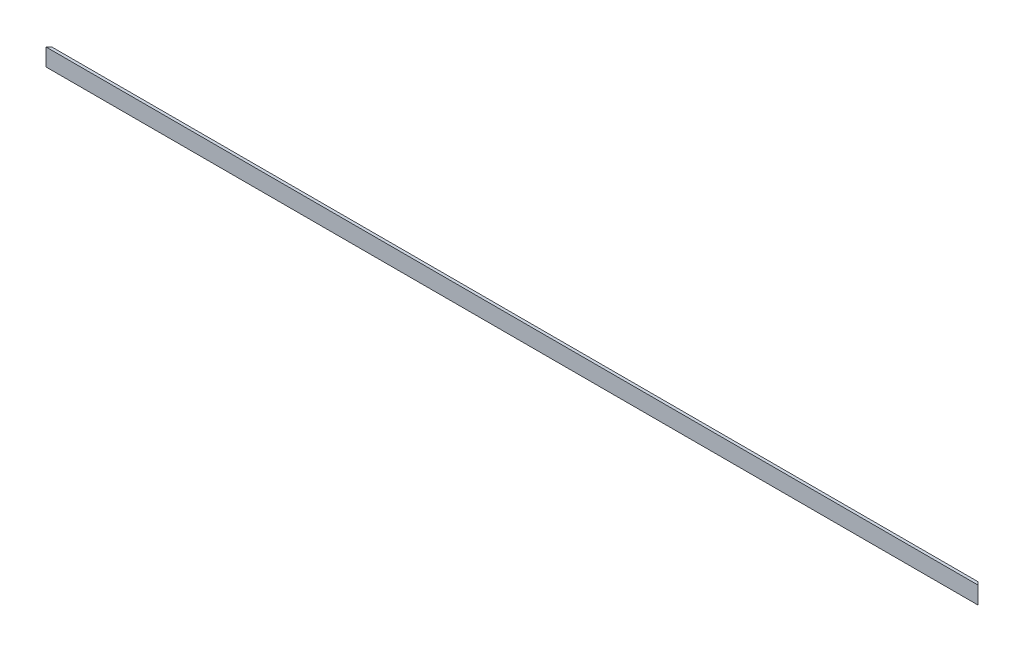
ISO-10303-21;
HEADER;
FILE_DESCRIPTION(('STEP AP214'),'2;1');
FILE_NAME('part.step','',(''),(''),'','','');
FILE_SCHEMA(('AUTOMOTIVE_DESIGN { 1 0 10303 214 1 1 1 1 }'));
ENDSEC;
DATA;
#1=APPLICATION_CONTEXT('core data for automotive mechanical design processes');
#2=APPLICATION_PROTOCOL_DEFINITION('international standard','automotive_design',2000,#1);
#3=PRODUCT_CONTEXT('',#1,'mechanical');
#4=PRODUCT('Part','Part','',(#3));
#5=PRODUCT_RELATED_PRODUCT_CATEGORY('part','',(#4));
#6=PRODUCT_DEFINITION_FORMATION('','',#4);
#7=PRODUCT_DEFINITION_CONTEXT('part definition',#1,'design');
#8=PRODUCT_DEFINITION('design','',#6,#7);
#9=PRODUCT_DEFINITION_SHAPE('','',#8);
#10=(LENGTH_UNIT() NAMED_UNIT(*) SI_UNIT(.MILLI.,.METRE.));
#11=(NAMED_UNIT(*) PLANE_ANGLE_UNIT() SI_UNIT($,.RADIAN.));
#12=(NAMED_UNIT(*) SI_UNIT($,.STERADIAN.) SOLID_ANGLE_UNIT());
#13=UNCERTAINTY_MEASURE_WITH_UNIT(LENGTH_MEASURE(1.E-05),#10,'distance_accuracy_value','');
#14=(GEOMETRIC_REPRESENTATION_CONTEXT(3) GLOBAL_UNCERTAINTY_ASSIGNED_CONTEXT((#13)) GLOBAL_UNIT_ASSIGNED_CONTEXT((#10,
#11,#12)) REPRESENTATION_CONTEXT('',''));
#15=CARTESIAN_POINT('',(0.,0.,0.));
#16=DIRECTION('',(0.,0.,1.));
#17=DIRECTION('',(1.,0.,0.));
#18=AXIS2_PLACEMENT_3D('',#15,#16,#17);
#19=CARTESIAN_POINT('',(2047.24,0.,0.));
#20=DIRECTION('',(0.,1.,0.));
#21=DIRECTION('',(0.,0.,1.));
#22=AXIS2_PLACEMENT_3D('',#19,#20,#21);
#23=PLANE('',#22);
#24=DIRECTION('',(0.707106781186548,0.,0.707106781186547));
#25=VECTOR('',#24,1.);
#26=CARTESIAN_POINT('',(2047.24,0.,0.));
#27=LINE('',#26,#25);
#28=CARTESIAN_POINT('',(2009.14,0.,-38.1));
#29=VERTEX_POINT('',#28);
#30=CARTESIAN_POINT('',(2047.24,0.,0.));
#31=VERTEX_POINT('',#30);
#32=EDGE_CURVE('E78',#29,#31,#27,.T.);
#33=ORIENTED_EDGE('',*,*,#32,.T.);
#34=DIRECTION('',(-1.,0.,0.));
#35=VECTOR('',#34,1.);
#36=CARTESIAN_POINT('',(2047.24,0.,0.));
#37=LINE('',#36,#35);
#38=CARTESIAN_POINT('',(0.,0.,0.));
#39=VERTEX_POINT('',#38);
#40=EDGE_CURVE('E99',#31,#39,#37,.T.);
#41=ORIENTED_EDGE('',*,*,#40,.T.);
#42=DIRECTION('',(0.707106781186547,0.,-0.707106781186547));
#43=VECTOR('',#42,1.);
#44=CARTESIAN_POINT('',(0.,0.,0.));
#45=LINE('',#44,#43);
#46=CARTESIAN_POINT('',(38.1,0.,-38.1));
#47=VERTEX_POINT('',#46);
#48=EDGE_CURVE('E98',#39,#47,#45,.T.);
#49=ORIENTED_EDGE('',*,*,#48,.T.);
#50=DIRECTION('',(-1.,0.,0.));
#51=VECTOR('',#50,1.);
#52=CARTESIAN_POINT('',(2047.24,0.,-38.1));
#53=LINE('',#52,#51);
#54=EDGE_CURVE('E11',#29,#47,#53,.T.);
#55=ORIENTED_EDGE('',*,*,#54,.F.);
#56=EDGE_LOOP('',(#33,#41,#49,#55));
#57=FACE_BOUND('',#56,.T.);
#58=ADVANCED_FACE('F33',(#57),#23,.F.);
#59=CARTESIAN_POINT('',(2047.24,0.,-38.1));
#60=DIRECTION('',(0.,0.,1.));
#61=DIRECTION('',(1.,0.,0.));
#62=AXIS2_PLACEMENT_3D('',#59,#60,#61);
#63=PLANE('',#62);
#64=DIRECTION('',(0.,-1.,0.));
#65=VECTOR('',#64,1.);
#66=CARTESIAN_POINT('',(2009.14,38.1,-38.1));
#67=LINE('',#66,#65);
#68=CARTESIAN_POINT('',(2009.14,6.35000000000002,-38.1));
#69=VERTEX_POINT('',#68);
#70=EDGE_CURVE('E81',#69,#29,#67,.T.);
#71=ORIENTED_EDGE('',*,*,#70,.T.);
#72=ORIENTED_EDGE('',*,*,#54,.T.);
#73=DIRECTION('',(0.,-1.,0.));
#74=VECTOR('',#73,1.);
#75=CARTESIAN_POINT('',(38.1,38.1,-38.1));
#76=LINE('',#75,#74);
#77=CARTESIAN_POINT('',(38.1,6.35000000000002,-38.1));
#78=VERTEX_POINT('',#77);
#79=EDGE_CURVE('E106',#78,#47,#76,.T.);
#80=ORIENTED_EDGE('',*,*,#79,.F.);
#81=DIRECTION('',(-1.,0.,0.));
#82=VECTOR('',#81,1.);
#83=CARTESIAN_POINT('',(2047.24,6.35,-38.1));
#84=LINE('',#83,#82);
#85=EDGE_CURVE('E41',#69,#78,#84,.T.);
#86=ORIENTED_EDGE('',*,*,#85,.F.);
#87=EDGE_LOOP('',(#71,#72,#80,#86));
#88=FACE_BOUND('',#87,.T.);
#89=ADVANCED_FACE('F92',(#88),#63,.F.);
#90=CARTESIAN_POINT('',(2047.24,6.35,-38.1));
#91=DIRECTION('',(0.,-1.,0.));
#92=DIRECTION('',(0.,0.,-1.));
#93=AXIS2_PLACEMENT_3D('',#90,#91,#92);
#94=PLANE('',#93);
#95=DIRECTION('',(0.707106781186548,0.,0.707106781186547));
#96=VECTOR('',#95,1.);
#97=CARTESIAN_POINT('',(2028.19,6.35,-19.05));
#98=LINE('',#97,#96);
#99=CARTESIAN_POINT('',(2040.89,6.35,-6.35000000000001));
#100=VERTEX_POINT('',#99);
#101=EDGE_CURVE('E103',#69,#100,#98,.T.);
#102=ORIENTED_EDGE('',*,*,#101,.F.);
#103=ORIENTED_EDGE('',*,*,#85,.T.);
#104=DIRECTION('',(0.707106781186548,0.,-0.707106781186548));
#105=VECTOR('',#104,1.);
#106=CARTESIAN_POINT('',(1042.67,6.35000000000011,-1042.67));
#107=LINE('',#106,#105);
#108=CARTESIAN_POINT('',(6.34999999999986,6.35,-6.35000000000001));
#109=VERTEX_POINT('',#108);
#110=EDGE_CURVE('E114',#109,#78,#107,.T.);
#111=ORIENTED_EDGE('',*,*,#110,.F.);
#112=DIRECTION('',(-1.,0.,0.));
#113=VECTOR('',#112,1.);
#114=CARTESIAN_POINT('',(2047.24,6.35,-6.35000000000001));
#115=LINE('',#114,#113);
#116=EDGE_CURVE('E126',#100,#109,#115,.T.);
#117=ORIENTED_EDGE('',*,*,#116,.F.);
#118=EDGE_LOOP('',(#102,#103,#111,#117));
#119=FACE_BOUND('',#118,.T.);
#120=ADVANCED_FACE('F129',(#119),#94,.F.);
#121=CARTESIAN_POINT('',(2047.24,38.1,-6.35));
#122=DIRECTION('',(0.,0.,1.));
#123=DIRECTION('',(0.,-1.,0.));
#124=AXIS2_PLACEMENT_3D('',#121,#122,#123);
#125=PLANE('',#124);
#126=DIRECTION('',(0.,1.,0.));
#127=VECTOR('',#126,1.);
#128=CARTESIAN_POINT('',(2040.89,38.1,-6.35));
#129=LINE('',#128,#127);
#130=CARTESIAN_POINT('',(2040.89,38.1,-6.34999999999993));
#131=VERTEX_POINT('',#130);
#132=EDGE_CURVE('E95',#100,#131,#129,.T.);
#133=ORIENTED_EDGE('',*,*,#132,.F.);
#134=ORIENTED_EDGE('',*,*,#116,.T.);
#135=DIRECTION('',(0.,-1.,0.));
#136=VECTOR('',#135,1.);
#137=CARTESIAN_POINT('',(6.34999999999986,38.0999999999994,-6.35));
#138=LINE('',#137,#136);
#139=CARTESIAN_POINT('',(6.35000000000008,38.1,-6.35000000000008));
#140=VERTEX_POINT('',#139);
#141=EDGE_CURVE('E111',#140,#109,#138,.T.);
#142=ORIENTED_EDGE('',*,*,#141,.F.);
#143=DIRECTION('',(-1.,0.,0.));
#144=VECTOR('',#143,1.);
#145=CARTESIAN_POINT('',(2047.24,38.1,-6.35));
#146=LINE('',#145,#144);
#147=EDGE_CURVE('E124',#131,#140,#146,.T.);
#148=ORIENTED_EDGE('',*,*,#147,.F.);
#149=EDGE_LOOP('',(#133,#134,#142,#148));
#150=FACE_BOUND('',#149,.T.);
#151=ADVANCED_FACE('F137',(#150),#125,.F.);
#152=CARTESIAN_POINT('',(2047.24,38.1,0.));
#153=DIRECTION('',(0.,-1.,0.));
#154=DIRECTION('',(0.,0.,-1.));
#155=AXIS2_PLACEMENT_3D('',#152,#153,#154);
#156=PLANE('',#155);
#157=DIRECTION('',(0.707106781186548,0.,0.707106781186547));
#158=VECTOR('',#157,1.);
#159=CARTESIAN_POINT('',(2047.24,38.1,0.));
#160=LINE('',#159,#158);
#161=CARTESIAN_POINT('',(2047.24,38.1,0.));
#162=VERTEX_POINT('',#161);
#163=EDGE_CURVE('E47',#131,#162,#160,.T.);
#164=ORIENTED_EDGE('',*,*,#163,.F.);
#165=ORIENTED_EDGE('',*,*,#147,.T.);
#166=DIRECTION('',(0.707106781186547,0.,-0.707106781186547));
#167=VECTOR('',#166,1.);
#168=CARTESIAN_POINT('',(0.,38.1,0.));
#169=LINE('',#168,#167);
#170=CARTESIAN_POINT('',(0.,38.1,0.));
#171=VERTEX_POINT('',#170);
#172=EDGE_CURVE('E102',#171,#140,#169,.T.);
#173=ORIENTED_EDGE('',*,*,#172,.F.);
#174=DIRECTION('',(-1.,0.,0.));
#175=VECTOR('',#174,1.);
#176=CARTESIAN_POINT('',(2047.24,38.1,0.));
#177=LINE('',#176,#175);
#178=EDGE_CURVE('E121',#162,#171,#177,.T.);
#179=ORIENTED_EDGE('',*,*,#178,.F.);
#180=EDGE_LOOP('',(#164,#165,#173,#179));
#181=FACE_BOUND('',#180,.T.);
#182=ADVANCED_FACE('F141',(#181),#156,.F.);
#183=CARTESIAN_POINT('',(2047.24,0.,0.));
#184=DIRECTION('',(0.,0.,-1.));
#185=DIRECTION('',(-1.,0.,0.));
#186=AXIS2_PLACEMENT_3D('',#183,#184,#185);
#187=PLANE('',#186);
#188=DIRECTION('',(0.,-1.,0.));
#189=VECTOR('',#188,1.);
#190=CARTESIAN_POINT('',(0.,0.,0.));
#191=LINE('',#190,#189);
#192=EDGE_CURVE('E117',#171,#39,#191,.T.);
#193=ORIENTED_EDGE('',*,*,#192,.T.);
#194=ORIENTED_EDGE('',*,*,#40,.F.);
#195=DIRECTION('',(0.,-1.,0.));
#196=VECTOR('',#195,1.);
#197=CARTESIAN_POINT('',(2047.24,0.,0.));
#198=LINE('',#197,#196);
#199=EDGE_CURVE('E84',#162,#31,#198,.T.);
#200=ORIENTED_EDGE('',*,*,#199,.F.);
#201=ORIENTED_EDGE('',*,*,#178,.T.);
#202=EDGE_LOOP('',(#193,#194,#200,#201));
#203=FACE_BOUND('',#202,.T.);
#204=ADVANCED_FACE('F143',(#203),#187,.F.);
#205=CARTESIAN_POINT('',(0.,38.1,0.));
#206=DIRECTION('',(-0.707106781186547,0.,-0.707106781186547));
#207=DIRECTION('',(-0.707106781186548,0.,0.707106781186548));
#208=AXIS2_PLACEMENT_3D('',#205,#206,#207);
#209=PLANE('',#208);
#210=ORIENTED_EDGE('',*,*,#110,.T.);
#211=ORIENTED_EDGE('',*,*,#79,.T.);
#212=ORIENTED_EDGE('',*,*,#48,.F.);
#213=ORIENTED_EDGE('',*,*,#192,.F.);
#214=ORIENTED_EDGE('',*,*,#172,.T.);
#215=ORIENTED_EDGE('',*,*,#141,.T.);
#216=EDGE_LOOP('',(#210,#211,#212,#213,#214,#215));
#217=FACE_BOUND('',#216,.T.);
#218=ADVANCED_FACE('F131',(#217),#209,.T.);
#219=CARTESIAN_POINT('',(2047.24,38.1,0.));
#220=DIRECTION('',(0.707106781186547,0.,-0.707106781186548));
#221=DIRECTION('',(-0.707106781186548,0.,-0.707106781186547));
#222=AXIS2_PLACEMENT_3D('',#219,#220,#221);
#223=PLANE('',#222);
#224=ORIENTED_EDGE('',*,*,#101,.T.);
#225=ORIENTED_EDGE('',*,*,#132,.T.);
#226=ORIENTED_EDGE('',*,*,#163,.T.);
#227=ORIENTED_EDGE('',*,*,#199,.T.);
#228=ORIENTED_EDGE('',*,*,#32,.F.);
#229=ORIENTED_EDGE('',*,*,#70,.F.);
#230=EDGE_LOOP('',(#224,#225,#226,#227,#228,#229));
#231=FACE_BOUND('',#230,.T.);
#232=ADVANCED_FACE('F80',(#231),#223,.T.);
#233=CLOSED_SHELL('',(#58,#89,#120,#151,#182,#204,#218,#232));
#234=MANIFOLD_SOLID_BREP('B2',#233);
#235=ADVANCED_BREP_SHAPE_REPRESENTATION('',(#18,#234),#14);
#236=SHAPE_DEFINITION_REPRESENTATION(#9,#235);
ENDSEC;
END-ISO-10303-21;
